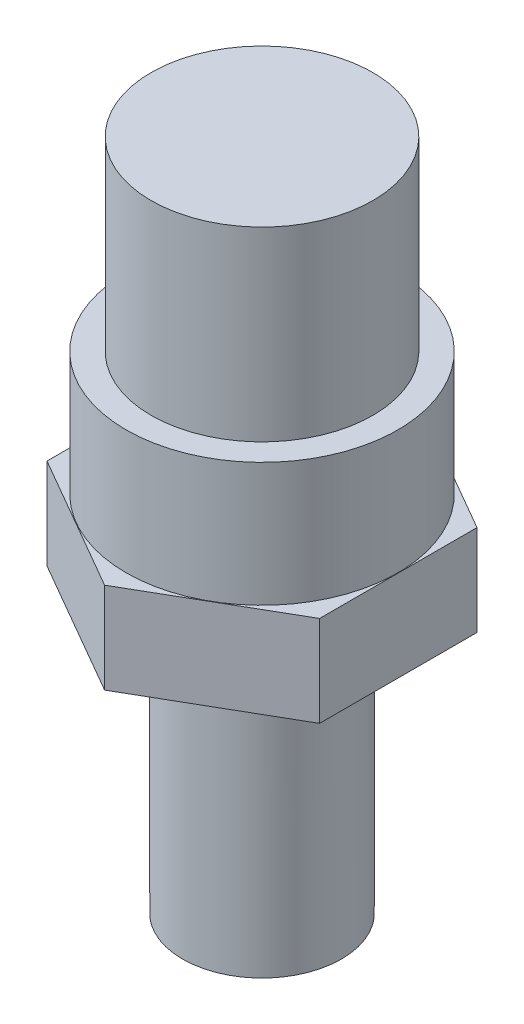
from build123d import *

# Parameters (mm, degrees)
BOSS_EXTRUDE1_DEPTH = 28
SKETCH2_R           = 5.55625
BOSS_EXTRUDE2_DEPTH = 19
SKETCH3_W           = 8.822349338
SKETCH3_H           = 13
SKETCH4_W           = 7.070673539
SKETCH4_H           = 9.282645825


with BuildPart() as part:
    # Sketch1 → Boss-Extrude1 (new body)
    with BuildSketch(Plane(origin=(0, 0, 0), x_dir=(1, 0, 0), z_dir=(0, 1, 0))):
        Polygon((0, 10.998522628), (-9.525, 5.499261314), (-9.525, -5.499261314), (0, -10.998522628), (9.525, -5.499261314), (9.525, 5.499261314), align=None)
    extrude(amount=BOSS_EXTRUDE1_DEPTH)

    # Sketch2 → Boss-Extrude2 (add)
    with BuildSketch(Plane.XZ):
        with Locations(Location((0, 0, 0), (0, 0, 90))):
            Circle(SKETCH2_R)
    extrude(amount=BOSS_EXTRUDE2_DEPTH)

    # Sketch3 → Cut-Revolve1 (revolve, cut)
    with BuildSketch(Plane(origin=(0, 0, 0), x_dir=(0, 0, -1), z_dir=(1, 0, 0)), mode=Mode.PRIVATE) as cut_revolve1_sk:
        with Locations((12.161174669, 21.5)):
            Rectangle(SKETCH3_W, SKETCH3_H)
    revolve(cut_revolve1_sk.sketch.rotate(Axis((0, 28, 0), (0, -1, 0)), 180), axis=Axis((0, 28, 0), (0, -1, 0)), mode=Mode.SUBTRACT)

    # Sketch4 → Cut-Revolve2 (revolve, cut)
    with BuildSketch(Plane(origin=(0, 0, 0), x_dir=(0, 0, -1), z_dir=(1, 0, 0)), mode=Mode.PRIVATE) as cut_revolve2_sk:
        with Locations((13.03533677, 10.991322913)):
            Rectangle(SKETCH4_W, SKETCH4_H)
    revolve(cut_revolve2_sk.sketch.rotate(Axis((0, 28, 0), (0, -1, 0)), 180), axis=Axis((0, 28, 0), (0, -1, 0)), mode=Mode.SUBTRACT)


solid = part.part
